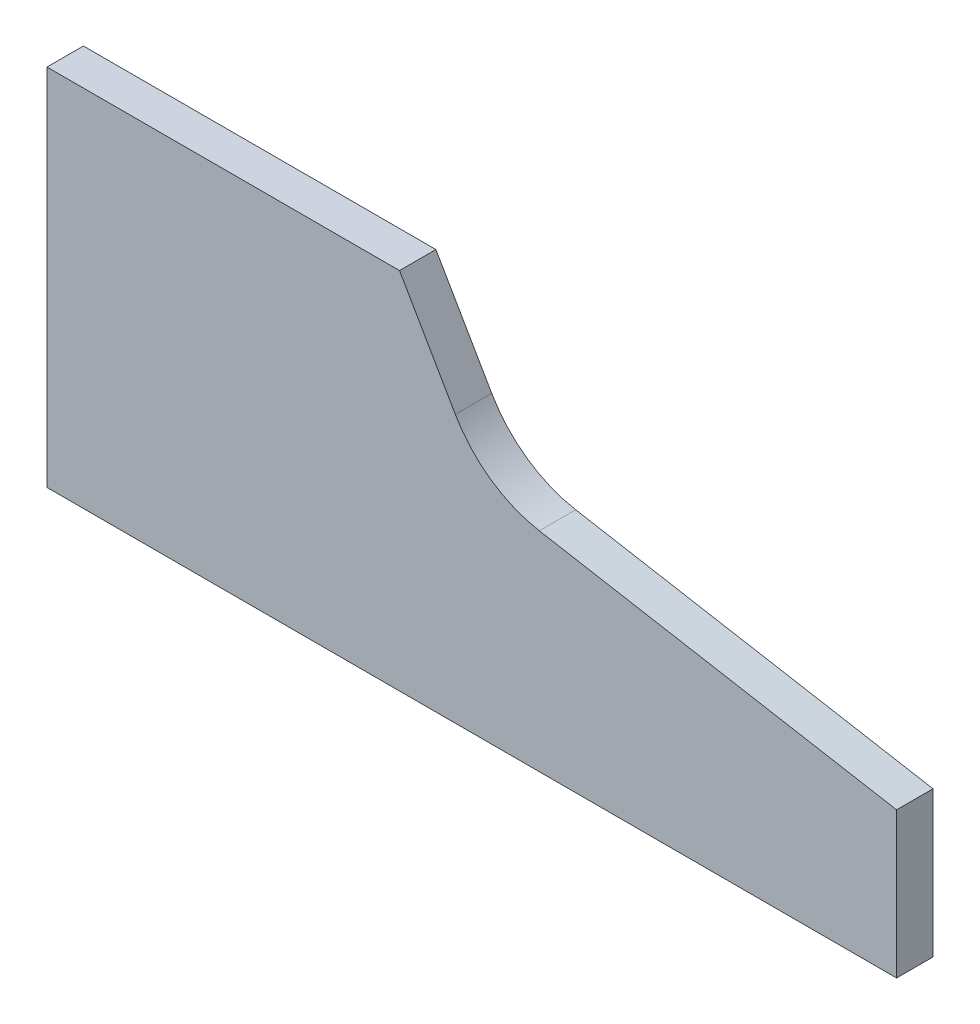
from build123d import *

# Parameters (mm, degrees)
AUFSATZ_LINEAR_AUSTRAGEN1_DEPTH = 1.5


with BuildPart() as part:
    # Skizze1 → Aufsatz-Linear austragen1 (new, symmetric)
    with BuildSketch(Plane.XY):
        with BuildLine():
            Line((0, 0), (0, 30))
            Line((0, 30), (29.044105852, 30))
            Line((29.044105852, 30), (33.640770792, 22.038342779))
            ThreePointArc((33.640770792, 22.038342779), (36.565260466, 18.846822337), (40.564543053, 17.190265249))
            Line((40.564543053, 17.190265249), (70, 12))
            Line((70, 12), (70, 0))
            Line((70, 0), (0, 0))
        make_face()
    extrude(amount=AUFSATZ_LINEAR_AUSTRAGEN1_DEPTH, both=True)


solid = part.part
